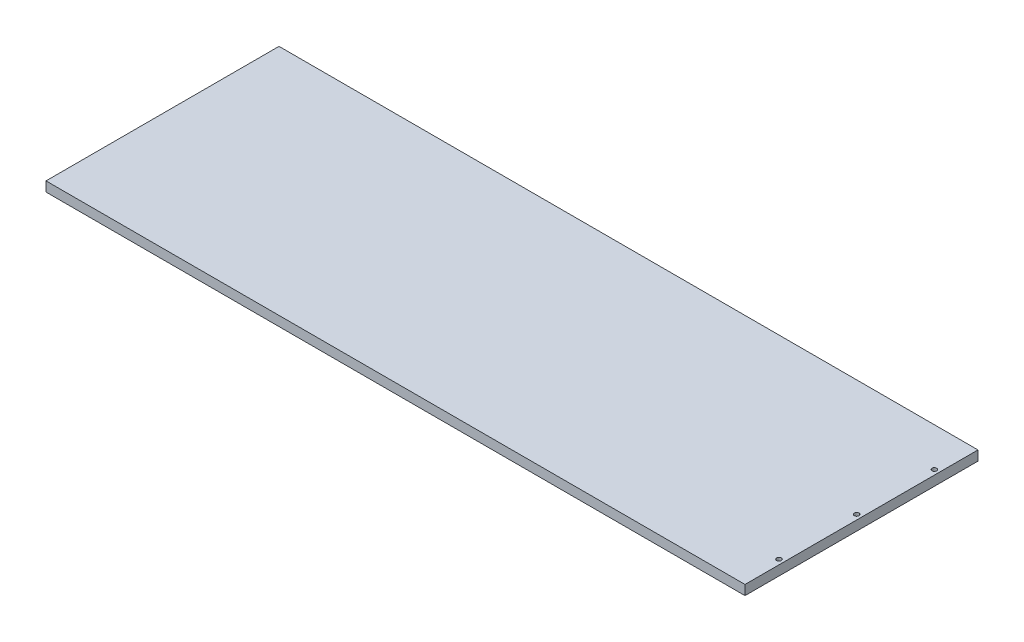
from build123d import *

# Parameters (mm, degrees)
SKETCH1_W                  = 457.2
SKETCH1_H                  = 152.4
BOSS_EXTRUDE1_DEPTH        = 6.35
F_4_40_TAPPED_HOLE1_D      = 2.2606
F_4_40_TAPPED_HOLE1_DEPTH  = 7.62
F_4_40_TAPPED_HOLE1_TIP    = 0.679152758
F_31_0_12_DIAMETER_HOLE1_D = 3.048


with BuildPart() as part:
    # Sketch1 → Boss-Extrude1 (new body)
    with BuildSketch(Plane(origin=(0, 0, 0), x_dir=(1, 0, 0), z_dir=(0, 1, 0))):
        Rectangle(SKETCH1_W, SKETCH1_H)
    extrude(amount=BOSS_EXTRUDE1_DEPTH)

    # 4-40 Tapped Hole1
    with Locations(Plane.ZY.offset(228.6)):
        with Locations((0, 3.175), (50.8, 3.175), (-50.8, 3.175)):
            Hole(F_4_40_TAPPED_HOLE1_D / 2, depth=F_4_40_TAPPED_HOLE1_DEPTH)
            with Locations((0, 0, -(F_4_40_TAPPED_HOLE1_DEPTH + F_4_40_TAPPED_HOLE1_TIP / 2))):  # 118° drill point
                Cone(0, F_4_40_TAPPED_HOLE1_D / 2, F_4_40_TAPPED_HOLE1_TIP, mode=Mode.SUBTRACT)

    # 31 _0.12_ Diameter Hole1 (through all)
    with Locations(Plane(origin=(0, 6.35, 0), x_dir=(1, 0, 0), z_dir=(0, 1, 0))):
        with Locations((225.425, 0), (225.425, 50.8), (225.425, -50.8)):
            Hole(F_31_0_12_DIAMETER_HOLE1_D / 2)


solid = part.part
